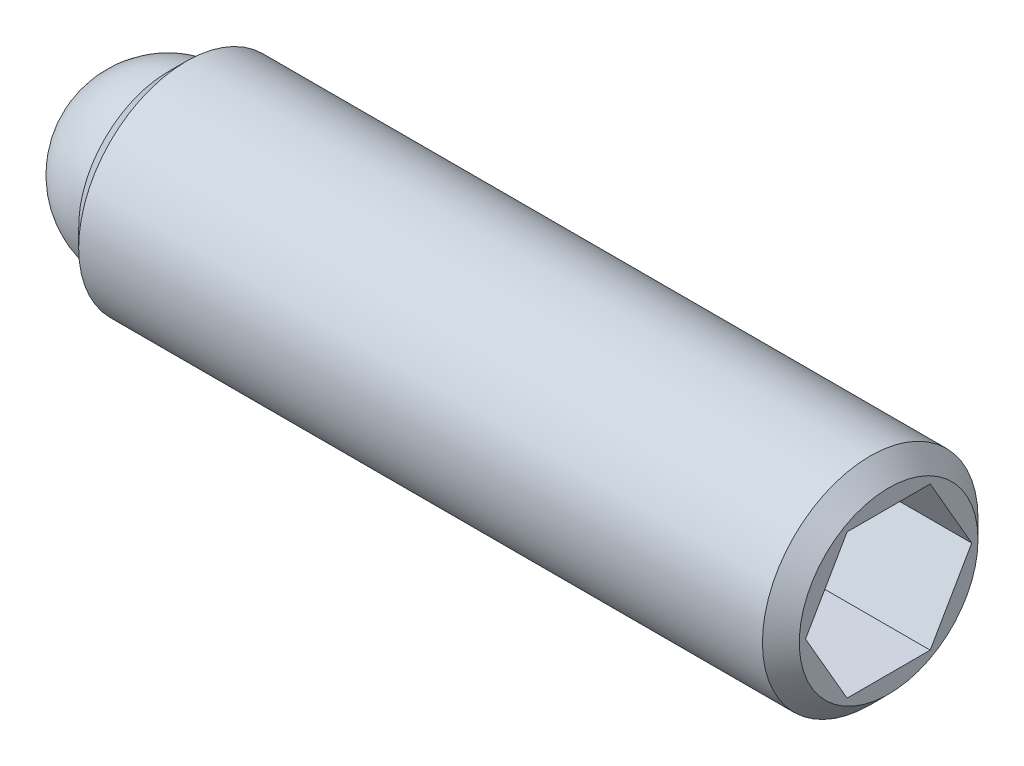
ISO-10303-21;
HEADER;
FILE_DESCRIPTION(('STEP AP214'),'2;1');
FILE_NAME('part.step','',(''),(''),'','','');
FILE_SCHEMA(('AUTOMOTIVE_DESIGN { 1 0 10303 214 1 1 1 1 }'));
ENDSEC;
DATA;
#1=APPLICATION_CONTEXT('core data for automotive mechanical design processes');
#2=APPLICATION_PROTOCOL_DEFINITION('international standard','automotive_design',2000,#1);
#3=PRODUCT_CONTEXT('',#1,'mechanical');
#4=PRODUCT('Part','Part','',(#3));
#5=PRODUCT_RELATED_PRODUCT_CATEGORY('part','',(#4));
#6=PRODUCT_DEFINITION_FORMATION('','',#4);
#7=PRODUCT_DEFINITION_CONTEXT('part definition',#1,'design');
#8=PRODUCT_DEFINITION('design','',#6,#7);
#9=PRODUCT_DEFINITION_SHAPE('','',#8);
#10=(LENGTH_UNIT() NAMED_UNIT(*) SI_UNIT(.MILLI.,.METRE.));
#11=(NAMED_UNIT(*) PLANE_ANGLE_UNIT() SI_UNIT($,.RADIAN.));
#12=(NAMED_UNIT(*) SI_UNIT($,.STERADIAN.) SOLID_ANGLE_UNIT());
#13=UNCERTAINTY_MEASURE_WITH_UNIT(LENGTH_MEASURE(1.E-05),#10,'distance_accuracy_value','');
#14=(GEOMETRIC_REPRESENTATION_CONTEXT(3) GLOBAL_UNCERTAINTY_ASSIGNED_CONTEXT((#13)) GLOBAL_UNIT_ASSIGNED_CONTEXT((#10,
#11,#12)) REPRESENTATION_CONTEXT('',''));
#15=CARTESIAN_POINT('',(0.,0.,0.));
#16=DIRECTION('',(0.,0.,1.));
#17=DIRECTION('',(1.,0.,0.));
#18=AXIS2_PLACEMENT_3D('',#15,#16,#17);
#19=CARTESIAN_POINT('',(0.,0.,0.));
#20=DIRECTION('',(0.,-1.,0.));
#21=DIRECTION('',(0.,0.,-1.));
#22=AXIS2_PLACEMENT_3D('',#19,#20,#21);
#23=SPHERICAL_SURFACE('',#22,1.190625);
#24=CARTESIAN_POINT('',(0.,-1.190625,0.));
#25=VERTEX_POINT('',#24);
#26=VERTEX_LOOP('',#25);
#27=FACE_BOUND('',#26,.T.);
#28=ADVANCED_FACE('F43',(#27),#23,.T.);
#29=CLOSED_SHELL('',(#28));
#30=MANIFOLD_SOLID_BREP('B2',#29);
#31=CARTESIAN_POINT('',(9.934575,0.,0.));
#32=DIRECTION('',(-1.,0.,0.));
#33=DIRECTION('',(0.,0.,1.));
#34=AXIS2_PLACEMENT_3D('',#31,#32,#33);
#35=CYLINDRICAL_SURFACE('',#34,1.4859);
#36=CARTESIAN_POINT('',(9.680575,0.,0.));
#37=DIRECTION('',(1.,0.,0.));
#38=DIRECTION('',(0.,0.,-1.));
#39=AXIS2_PLACEMENT_3D('',#36,#37,#38);
#40=CIRCLE('',#39,1.4859);
#41=CARTESIAN_POINT('',(9.680575,0.,-1.4859));
#42=VERTEX_POINT('',#41);
#43=EDGE_CURVE('E41',#42,#42,#40,.F.);
#44=ORIENTED_EDGE('',*,*,#43,.T.);
#45=EDGE_LOOP('',(#44));
#46=FACE_BOUND('',#45,.T.);
#47=CARTESIAN_POINT('',(0.254000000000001,0.,0.));
#48=DIRECTION('',(1.,0.,0.));
#49=DIRECTION('',(0.,0.,-1.));
#50=AXIS2_PLACEMENT_3D('',#47,#48,#49);
#51=CIRCLE('',#50,1.4859);
#52=CARTESIAN_POINT('',(0.254000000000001,0.,-1.4859));
#53=VERTEX_POINT('',#52);
#54=EDGE_CURVE('E159',#53,#53,#51,.T.);
#55=ORIENTED_EDGE('',*,*,#54,.T.);
#56=EDGE_LOOP('',(#55));
#57=FACE_BOUND('',#56,.T.);
#58=ADVANCED_FACE('F56',(#46,#57),#35,.T.);
#59=CARTESIAN_POINT('',(9.934575,0.,0.));
#60=DIRECTION('',(1.,0.,0.));
#61=DIRECTION('',(0.,0.,-1.));
#62=AXIS2_PLACEMENT_3D('',#59,#60,#61);
#63=PLANE('',#62);
#64=DIRECTION('',(0.,0.866025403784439,-0.5));
#65=VECTOR('',#64,1.);
#66=CARTESIAN_POINT('',(9.934575,-0.992187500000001,-0.572839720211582));
#67=LINE('',#66,#65);
#68=CARTESIAN_POINT('',(9.934575,-0.992187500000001,-0.572839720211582));
#69=VERTEX_POINT('',#68);
#70=CARTESIAN_POINT('',(9.934575,0.,-1.14567944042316));
#71=VERTEX_POINT('',#70);
#72=EDGE_CURVE('E71',#69,#71,#67,.T.);
#73=ORIENTED_EDGE('',*,*,#72,.F.);
#74=DIRECTION('',(0.,0.,-1.));
#75=VECTOR('',#74,1.);
#76=CARTESIAN_POINT('',(9.934575,-0.992187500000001,0.572839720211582));
#77=LINE('',#76,#75);
#78=CARTESIAN_POINT('',(9.934575,-0.992187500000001,0.572839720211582));
#79=VERTEX_POINT('',#78);
#80=EDGE_CURVE('E155',#79,#69,#77,.T.);
#81=ORIENTED_EDGE('',*,*,#80,.F.);
#82=DIRECTION('',(0.,-0.866025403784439,-0.5));
#83=VECTOR('',#82,1.);
#84=CARTESIAN_POINT('',(9.934575,0.,1.14567944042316));
#85=LINE('',#84,#83);
#86=CARTESIAN_POINT('',(9.934575,0.,1.14567944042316));
#87=VERTEX_POINT('',#86);
#88=EDGE_CURVE('E153',#87,#79,#85,.T.);
#89=ORIENTED_EDGE('',*,*,#88,.F.);
#90=DIRECTION('',(0.,-0.866025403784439,0.5));
#91=VECTOR('',#90,1.);
#92=CARTESIAN_POINT('',(9.934575,0.992187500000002,0.572839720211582));
#93=LINE('',#92,#91);
#94=CARTESIAN_POINT('',(9.934575,0.992187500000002,0.572839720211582));
#95=VERTEX_POINT('',#94);
#96=EDGE_CURVE('E119',#95,#87,#93,.T.);
#97=ORIENTED_EDGE('',*,*,#96,.F.);
#98=DIRECTION('',(0.,0.,1.));
#99=VECTOR('',#98,1.);
#100=CARTESIAN_POINT('',(9.934575,0.992187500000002,-0.572839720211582));
#101=LINE('',#100,#99);
#102=CARTESIAN_POINT('',(9.934575,0.992187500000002,-0.572839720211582));
#103=VERTEX_POINT('',#102);
#104=EDGE_CURVE('E149',#103,#95,#101,.T.);
#105=ORIENTED_EDGE('',*,*,#104,.F.);
#106=DIRECTION('',(0.,0.866025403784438,0.5));
#107=VECTOR('',#106,1.);
#108=CARTESIAN_POINT('',(9.934575,0.,-1.14567944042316));
#109=LINE('',#108,#107);
#110=EDGE_CURVE('E145',#71,#103,#109,.T.);
#111=ORIENTED_EDGE('',*,*,#110,.F.);
#112=EDGE_LOOP('',(#73,#81,#89,#97,#105,#111));
#113=FACE_BOUND('',#112,.T.);
#114=CARTESIAN_POINT('',(9.934575,0.,0.));
#115=DIRECTION('',(1.,0.,0.));
#116=DIRECTION('',(0.,0.,-1.));
#117=AXIS2_PLACEMENT_3D('',#114,#115,#116);
#118=CIRCLE('',#117,1.2319);
#119=CARTESIAN_POINT('',(9.934575,0.,-1.2319));
#120=VERTEX_POINT('',#119);
#121=EDGE_CURVE('E64',#120,#120,#118,.T.);
#122=ORIENTED_EDGE('',*,*,#121,.T.);
#123=EDGE_LOOP('',(#122));
#124=FACE_BOUND('',#123,.T.);
#125=ADVANCED_FACE('F172',(#113,#124),#63,.T.);
#126=CARTESIAN_POINT('',(0.,0.,0.));
#127=DIRECTION('',(1.,0.,0.));
#128=DIRECTION('',(0.,0.,-1.));
#129=AXIS2_PLACEMENT_3D('',#126,#127,#128);
#130=PLANE('',#129);
#131=CARTESIAN_POINT('',(0.,0.,0.));
#132=DIRECTION('',(-1.,0.,0.));
#133=DIRECTION('',(0.,0.,1.));
#134=AXIS2_PLACEMENT_3D('',#131,#132,#133);
#135=CIRCLE('',#134,1.190625);
#136=CARTESIAN_POINT('',(0.,0.,1.190625));
#137=VERTEX_POINT('',#136);
#138=EDGE_CURVE('E227',#137,#137,#135,.T.);
#139=ORIENTED_EDGE('',*,*,#138,.F.);
#140=EDGE_LOOP('',(#139));
#141=FACE_BOUND('',#140,.T.);
#142=CARTESIAN_POINT('',(0.,0.,0.));
#143=DIRECTION('',(1.,0.,0.));
#144=DIRECTION('',(0.,0.,-1.));
#145=AXIS2_PLACEMENT_3D('',#142,#143,#144);
#146=CIRCLE('',#145,1.2319);
#147=CARTESIAN_POINT('',(0.,0.,-1.2319));
#148=VERTEX_POINT('',#147);
#149=EDGE_CURVE('E167',#148,#148,#146,.F.);
#150=ORIENTED_EDGE('',*,*,#149,.T.);
#151=EDGE_LOOP('',(#150));
#152=FACE_BOUND('',#151,.T.);
#153=ADVANCED_FACE('F184',(#141,#152),#130,.F.);
#154=CARTESIAN_POINT('',(0.254000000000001,0.,0.));
#155=DIRECTION('',(1.,0.,0.));
#156=DIRECTION('',(0.,0.,-1.));
#157=AXIS2_PLACEMENT_3D('',#154,#155,#156);
#158=CONICAL_SURFACE('',#157,1.4859,0.78539816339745);
#159=ORIENTED_EDGE('',*,*,#149,.F.);
#160=EDGE_LOOP('',(#159));
#161=FACE_BOUND('',#160,.T.);
#162=ORIENTED_EDGE('',*,*,#54,.F.);
#163=EDGE_LOOP('',(#162));
#164=FACE_BOUND('',#163,.T.);
#165=ADVANCED_FACE('F176',(#161,#164),#158,.T.);
#166=CARTESIAN_POINT('',(9.934575,0.,0.));
#167=DIRECTION('',(-1.,0.,0.));
#168=DIRECTION('',(0.,0.,1.));
#169=AXIS2_PLACEMENT_3D('',#166,#167,#168);
#170=CONICAL_SURFACE('',#169,1.2319,0.785398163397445);
#171=ORIENTED_EDGE('',*,*,#43,.F.);
#172=EDGE_LOOP('',(#171));
#173=FACE_BOUND('',#172,.T.);
#174=ORIENTED_EDGE('',*,*,#121,.F.);
#175=EDGE_LOOP('',(#174));
#176=FACE_BOUND('',#175,.T.);
#177=ADVANCED_FACE('F58',(#173,#176),#170,.T.);
#178=CARTESIAN_POINT('',(7.648575,-0.992187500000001,-0.572839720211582));
#179=DIRECTION('',(0.,-0.5,-0.866025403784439));
#180=DIRECTION('',(0.,0.866025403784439,-0.5));
#181=AXIS2_PLACEMENT_3D('',#178,#179,#180);
#182=PLANE('',#181);
#183=ORIENTED_EDGE('',*,*,#72,.T.);
#184=DIRECTION('',(1.,0.,0.));
#185=VECTOR('',#184,1.);
#186=CARTESIAN_POINT('',(7.648575,0.,-1.14567944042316));
#187=LINE('',#186,#185);
#188=CARTESIAN_POINT('',(7.648575,0.,-1.14567944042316));
#189=VERTEX_POINT('',#188);
#190=EDGE_CURVE('E101',#189,#71,#187,.T.);
#191=ORIENTED_EDGE('',*,*,#190,.F.);
#192=DIRECTION('',(0.,0.866025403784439,-0.5));
#193=VECTOR('',#192,1.);
#194=CARTESIAN_POINT('',(7.648575,-0.992187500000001,-0.572839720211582));
#195=LINE('',#194,#193);
#196=CARTESIAN_POINT('',(7.648575,-0.992187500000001,-0.572839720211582));
#197=VERTEX_POINT('',#196);
#198=EDGE_CURVE('E157',#197,#189,#195,.T.);
#199=ORIENTED_EDGE('',*,*,#198,.F.);
#200=DIRECTION('',(1.,0.,0.));
#201=VECTOR('',#200,1.);
#202=CARTESIAN_POINT('',(7.648575,-0.992187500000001,-0.572839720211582));
#203=LINE('',#202,#201);
#204=EDGE_CURVE('E79',#197,#69,#203,.T.);
#205=ORIENTED_EDGE('',*,*,#204,.T.);
#206=EDGE_LOOP('',(#183,#191,#199,#205));
#207=FACE_BOUND('',#206,.T.);
#208=ADVANCED_FACE('F175',(#207),#182,.F.);
#209=CARTESIAN_POINT('',(7.648575,-0.992187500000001,0.572839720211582));
#210=DIRECTION('',(0.,-1.,0.));
#211=DIRECTION('',(0.,0.,-1.));
#212=AXIS2_PLACEMENT_3D('',#209,#210,#211);
#213=PLANE('',#212);
#214=ORIENTED_EDGE('',*,*,#80,.T.);
#215=ORIENTED_EDGE('',*,*,#204,.F.);
#216=DIRECTION('',(0.,0.,-1.));
#217=VECTOR('',#216,1.);
#218=CARTESIAN_POINT('',(7.648575,-0.992187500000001,0.572839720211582));
#219=LINE('',#218,#217);
#220=CARTESIAN_POINT('',(7.648575,-0.992187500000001,0.572839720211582));
#221=VERTEX_POINT('',#220);
#222=EDGE_CURVE('E131',#221,#197,#219,.T.);
#223=ORIENTED_EDGE('',*,*,#222,.F.);
#224=DIRECTION('',(1.,0.,0.));
#225=VECTOR('',#224,1.);
#226=CARTESIAN_POINT('',(7.648575,-0.992187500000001,0.572839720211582));
#227=LINE('',#226,#225);
#228=EDGE_CURVE('E123',#221,#79,#227,.T.);
#229=ORIENTED_EDGE('',*,*,#228,.T.);
#230=EDGE_LOOP('',(#214,#215,#223,#229));
#231=FACE_BOUND('',#230,.T.);
#232=ADVANCED_FACE('F182',(#231),#213,.F.);
#233=CARTESIAN_POINT('',(7.648575,0.,1.14567944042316));
#234=DIRECTION('',(0.,-0.5,0.866025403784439));
#235=DIRECTION('',(0.,-0.866025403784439,-0.5));
#236=AXIS2_PLACEMENT_3D('',#233,#234,#235);
#237=PLANE('',#236);
#238=ORIENTED_EDGE('',*,*,#88,.T.);
#239=ORIENTED_EDGE('',*,*,#228,.F.);
#240=DIRECTION('',(0.,-0.866025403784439,-0.5));
#241=VECTOR('',#240,1.);
#242=CARTESIAN_POINT('',(7.648575,0.,1.14567944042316));
#243=LINE('',#242,#241);
#244=CARTESIAN_POINT('',(7.648575,0.,1.14567944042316));
#245=VERTEX_POINT('',#244);
#246=EDGE_CURVE('E127',#245,#221,#243,.T.);
#247=ORIENTED_EDGE('',*,*,#246,.F.);
#248=DIRECTION('',(1.,0.,0.));
#249=VECTOR('',#248,1.);
#250=CARTESIAN_POINT('',(7.648575,0.,1.14567944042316));
#251=LINE('',#250,#249);
#252=EDGE_CURVE('E112',#245,#87,#251,.T.);
#253=ORIENTED_EDGE('',*,*,#252,.T.);
#254=EDGE_LOOP('',(#238,#239,#247,#253));
#255=FACE_BOUND('',#254,.T.);
#256=ADVANCED_FACE('F128',(#255),#237,.F.);
#257=CARTESIAN_POINT('',(7.648575,0.992187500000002,0.572839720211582));
#258=DIRECTION('',(0.,0.5,0.866025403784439));
#259=DIRECTION('',(0.,-0.866025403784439,0.5));
#260=AXIS2_PLACEMENT_3D('',#257,#258,#259);
#261=PLANE('',#260);
#262=ORIENTED_EDGE('',*,*,#96,.T.);
#263=ORIENTED_EDGE('',*,*,#252,.F.);
#264=DIRECTION('',(0.,-0.866025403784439,0.5));
#265=VECTOR('',#264,1.);
#266=CARTESIAN_POINT('',(7.648575,0.992187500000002,0.572839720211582));
#267=LINE('',#266,#265);
#268=CARTESIAN_POINT('',(7.648575,0.992187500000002,0.572839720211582));
#269=VERTEX_POINT('',#268);
#270=EDGE_CURVE('E116',#269,#245,#267,.T.);
#271=ORIENTED_EDGE('',*,*,#270,.F.);
#272=DIRECTION('',(1.,0.,0.));
#273=VECTOR('',#272,1.);
#274=CARTESIAN_POINT('',(7.648575,0.992187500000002,0.572839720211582));
#275=LINE('',#274,#273);
#276=EDGE_CURVE('E124',#269,#95,#275,.T.);
#277=ORIENTED_EDGE('',*,*,#276,.T.);
#278=EDGE_LOOP('',(#262,#263,#271,#277));
#279=FACE_BOUND('',#278,.T.);
#280=ADVANCED_FACE('F114',(#279),#261,.F.);
#281=CARTESIAN_POINT('',(7.648575,0.992187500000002,-0.572839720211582));
#282=DIRECTION('',(0.,1.,0.));
#283=DIRECTION('',(0.,0.,1.));
#284=AXIS2_PLACEMENT_3D('',#281,#282,#283);
#285=PLANE('',#284);
#286=ORIENTED_EDGE('',*,*,#104,.T.);
#287=ORIENTED_EDGE('',*,*,#276,.F.);
#288=DIRECTION('',(0.,0.,1.));
#289=VECTOR('',#288,1.);
#290=CARTESIAN_POINT('',(7.648575,0.992187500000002,-0.572839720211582));
#291=LINE('',#290,#289);
#292=CARTESIAN_POINT('',(7.648575,0.992187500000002,-0.572839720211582));
#293=VERTEX_POINT('',#292);
#294=EDGE_CURVE('E137',#293,#269,#291,.T.);
#295=ORIENTED_EDGE('',*,*,#294,.F.);
#296=DIRECTION('',(1.,0.,0.));
#297=VECTOR('',#296,1.);
#298=CARTESIAN_POINT('',(7.648575,0.992187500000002,-0.572839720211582));
#299=LINE('',#298,#297);
#300=EDGE_CURVE('E162',#293,#103,#299,.T.);
#301=ORIENTED_EDGE('',*,*,#300,.T.);
#302=EDGE_LOOP('',(#286,#287,#295,#301));
#303=FACE_BOUND('',#302,.T.);
#304=ADVANCED_FACE('F203',(#303),#285,.F.);
#305=CARTESIAN_POINT('',(7.648575,0.,-1.14567944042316));
#306=DIRECTION('',(0.,0.5,-0.866025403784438));
#307=DIRECTION('',(0.,0.866025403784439,0.5));
#308=AXIS2_PLACEMENT_3D('',#305,#306,#307);
#309=PLANE('',#308);
#310=ORIENTED_EDGE('',*,*,#110,.T.);
#311=ORIENTED_EDGE('',*,*,#300,.F.);
#312=DIRECTION('',(0.,0.866025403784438,0.5));
#313=VECTOR('',#312,1.);
#314=CARTESIAN_POINT('',(7.648575,0.,-1.14567944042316));
#315=LINE('',#314,#313);
#316=EDGE_CURVE('E139',#189,#293,#315,.T.);
#317=ORIENTED_EDGE('',*,*,#316,.F.);
#318=ORIENTED_EDGE('',*,*,#190,.T.);
#319=EDGE_LOOP('',(#310,#311,#317,#318));
#320=FACE_BOUND('',#319,.T.);
#321=ADVANCED_FACE('F200',(#320),#309,.F.);
#322=CARTESIAN_POINT('',(7.648575,0.,0.));
#323=DIRECTION('',(1.,0.,0.));
#324=DIRECTION('',(0.,0.,-1.));
#325=AXIS2_PLACEMENT_3D('',#322,#323,#324);
#326=PLANE('',#325);
#327=ORIENTED_EDGE('',*,*,#198,.T.);
#328=ORIENTED_EDGE('',*,*,#316,.T.);
#329=ORIENTED_EDGE('',*,*,#294,.T.);
#330=ORIENTED_EDGE('',*,*,#270,.T.);
#331=ORIENTED_EDGE('',*,*,#246,.T.);
#332=ORIENTED_EDGE('',*,*,#222,.T.);
#333=EDGE_LOOP('',(#327,#328,#329,#330,#331,#332));
#334=FACE_BOUND('',#333,.T.);
#335=ADVANCED_FACE('F134',(#334),#326,.T.);
#336=CARTESIAN_POINT('',(1.190625,0.,0.));
#337=DIRECTION('',(-1.,0.,0.));
#338=DIRECTION('',(0.,0.,1.));
#339=AXIS2_PLACEMENT_3D('',#336,#337,#338);
#340=CYLINDRICAL_SURFACE('',#339,1.190625);
#341=CARTESIAN_POINT('',(1.190625,0.,0.));
#342=DIRECTION('',(-1.,0.,0.));
#343=DIRECTION('',(0.,0.,1.));
#344=AXIS2_PLACEMENT_3D('',#341,#342,#343);
#345=CIRCLE('',#344,1.190625);
#346=CARTESIAN_POINT('',(1.190625,0.,1.190625));
#347=VERTEX_POINT('',#346);
#348=EDGE_CURVE('E146',#347,#347,#345,.T.);
#349=CARTESIAN_POINT('',(1.190625,0.,1.190625));
#350=CARTESIAN_POINT('',(1.17822265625,0.,1.190625));
#351=CARTESIAN_POINT('',(1.1658203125,0.,1.190625));
#352=CARTESIAN_POINT('',(1.141015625,0.,1.190625));
#353=CARTESIAN_POINT('',(1.12861328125,0.,1.190625));
#354=CARTESIAN_POINT('',(1.10380859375,0.,1.190625));
#355=CARTESIAN_POINT('',(1.09140625,0.,1.190625));
#356=CARTESIAN_POINT('',(1.0666015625,0.,1.190625));
#357=CARTESIAN_POINT('',(1.05419921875,0.,1.190625));
#358=CARTESIAN_POINT('',(1.02939453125,0.,1.190625));
#359=CARTESIAN_POINT('',(1.0169921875,0.,1.190625));
#360=CARTESIAN_POINT('',(0.9921875,0.,1.190625));
#361=CARTESIAN_POINT('',(0.97978515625,0.,1.190625));
#362=CARTESIAN_POINT('',(0.95498046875,0.,1.190625));
#363=CARTESIAN_POINT('',(0.942578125,0.,1.190625));
#364=CARTESIAN_POINT('',(0.9177734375,0.,1.190625));
#365=CARTESIAN_POINT('',(0.90537109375,0.,1.190625));
#366=CARTESIAN_POINT('',(0.88056640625,0.,1.190625));
#367=CARTESIAN_POINT('',(0.8681640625,0.,1.190625));
#368=CARTESIAN_POINT('',(0.843359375,0.,1.190625));
#369=CARTESIAN_POINT('',(0.83095703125,0.,1.190625));
#370=CARTESIAN_POINT('',(0.80615234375,0.,1.190625));
#371=CARTESIAN_POINT('',(0.79375,0.,1.190625));
#372=CARTESIAN_POINT('',(0.7689453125,0.,1.190625));
#373=CARTESIAN_POINT('',(0.75654296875,0.,1.190625));
#374=CARTESIAN_POINT('',(0.73173828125,0.,1.190625));
#375=CARTESIAN_POINT('',(0.7193359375,0.,1.190625));
#376=CARTESIAN_POINT('',(0.69453125,0.,1.190625));
#377=CARTESIAN_POINT('',(0.68212890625,0.,1.190625));
#378=CARTESIAN_POINT('',(0.65732421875,0.,1.190625));
#379=CARTESIAN_POINT('',(0.644921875,0.,1.190625));
#380=CARTESIAN_POINT('',(0.6201171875,0.,1.190625));
#381=CARTESIAN_POINT('',(0.60771484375,0.,1.190625));
#382=CARTESIAN_POINT('',(0.58291015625,0.,1.190625));
#383=CARTESIAN_POINT('',(0.5705078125,0.,1.190625));
#384=CARTESIAN_POINT('',(0.545703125,0.,1.190625));
#385=CARTESIAN_POINT('',(0.53330078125,0.,1.190625));
#386=CARTESIAN_POINT('',(0.50849609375,0.,1.190625));
#387=CARTESIAN_POINT('',(0.49609375,0.,1.190625));
#388=CARTESIAN_POINT('',(0.4712890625,0.,1.190625));
#389=CARTESIAN_POINT('',(0.45888671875,0.,1.190625));
#390=CARTESIAN_POINT('',(0.43408203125,0.,1.190625));
#391=CARTESIAN_POINT('',(0.4216796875,0.,1.190625));
#392=CARTESIAN_POINT('',(0.396875,0.,1.190625));
#393=CARTESIAN_POINT('',(0.38447265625,0.,1.190625));
#394=CARTESIAN_POINT('',(0.35966796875,0.,1.190625));
#395=CARTESIAN_POINT('',(0.347265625,0.,1.190625));
#396=CARTESIAN_POINT('',(0.3224609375,0.,1.190625));
#397=CARTESIAN_POINT('',(0.31005859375,0.,1.190625));
#398=CARTESIAN_POINT('',(0.28525390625,0.,1.190625));
#399=CARTESIAN_POINT('',(0.2728515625,0.,1.190625));
#400=CARTESIAN_POINT('',(0.248046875,0.,1.190625));
#401=CARTESIAN_POINT('',(0.23564453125,0.,1.190625));
#402=CARTESIAN_POINT('',(0.21083984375,0.,1.190625));
#403=CARTESIAN_POINT('',(0.1984375,0.,1.190625));
#404=CARTESIAN_POINT('',(0.1736328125,0.,1.190625));
#405=CARTESIAN_POINT('',(0.16123046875,0.,1.190625));
#406=CARTESIAN_POINT('',(0.13642578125,0.,1.190625));
#407=CARTESIAN_POINT('',(0.1240234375,0.,1.190625));
#408=CARTESIAN_POINT('',(0.0992187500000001,0.,1.190625));
#409=CARTESIAN_POINT('',(0.08681640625,0.,1.190625));
#410=CARTESIAN_POINT('',(0.06201171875,0.,1.190625));
#411=CARTESIAN_POINT('',(0.049609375,0.,1.190625));
#412=CARTESIAN_POINT('',(0.0248046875,0.,1.190625));
#413=CARTESIAN_POINT('',(0.01240234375,0.,1.190625));
#414=CARTESIAN_POINT('',(0.,0.,1.190625));
#415=B_SPLINE_CURVE_WITH_KNOTS('',3,(#349,#350,#351,#352,#353,#354,#355,#356,#357,#358,#359,
#360,#361,#362,#363,#364,#365,#366,#367,#368,#369,#370,#371,#372,#373,#374,#375,#376,#377,#378,
#379,#380,#381,#382,#383,#384,#385,#386,#387,#388,#389,#390,#391,#392,#393,#394,#395,#396,#397,
#398,#399,#400,#401,#402,#403,#404,#405,#406,#407,#408,#409,#410,#411,#412,#413,#414),
.UNSPECIFIED.,.F.,.F.,(4,2,2,2,2,2,2,2,2,2,2,2,2,2,2,2,2,2,2,2,2,2,2,2,2,2,2,2,2,2,2,2,4),(0.,
0.03720703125,0.0744140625,0.11162109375,0.148828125,0.18603515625,0.2232421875,0.26044921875,
0.29765625,0.33486328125,0.3720703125,0.40927734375,0.446484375,0.48369140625,0.5208984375,
0.55810546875,0.5953125,0.63251953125,0.6697265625,0.70693359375,0.744140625,0.78134765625,
0.8185546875,0.85576171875,0.89296875,0.93017578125,0.9673828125,1.00458984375,1.041796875,
1.07900390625,1.1162109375,1.15341796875,1.190625),.UNSPECIFIED.);
#416=EDGE_CURVE('BSEAM216',#347,#137,#415,.T.);
#417=ORIENTED_EDGE('',*,*,#348,.F.);
#418=ORIENTED_EDGE('',*,*,#138,.T.);
#419=ORIENTED_EDGE('',*,*,#416,.T.);
#420=ORIENTED_EDGE('',*,*,#416,.F.);
#421=EDGE_LOOP('',(#417,#419,#418,#420));
#422=FACE_BOUND('',#421,.T.);
#423=ADVANCED_FACE('F216',(#422),#340,.F.);
#424=CARTESIAN_POINT('',(1.190625,0.,0.));
#425=DIRECTION('',(-1.,0.,0.));
#426=DIRECTION('',(0.,0.,1.));
#427=AXIS2_PLACEMENT_3D('',#424,#425,#426);
#428=PLANE('',#427);
#429=ORIENTED_EDGE('',*,*,#348,.T.);
#430=EDGE_LOOP('',(#429));
#431=FACE_BOUND('',#430,.T.);
#432=ADVANCED_FACE('F219',(#431),#428,.T.);
#433=CLOSED_SHELL('',(#58,#125,#153,#165,#177,#208,#232,#256,#280,#304,#321,#335,#423,#432));
#434=MANIFOLD_SOLID_BREP('B6',#433);
#435=ADVANCED_BREP_SHAPE_REPRESENTATION('',(#18,#30,#434),#14);
#436=SHAPE_DEFINITION_REPRESENTATION(#9,#435);
ENDSEC;
END-ISO-10303-21;
